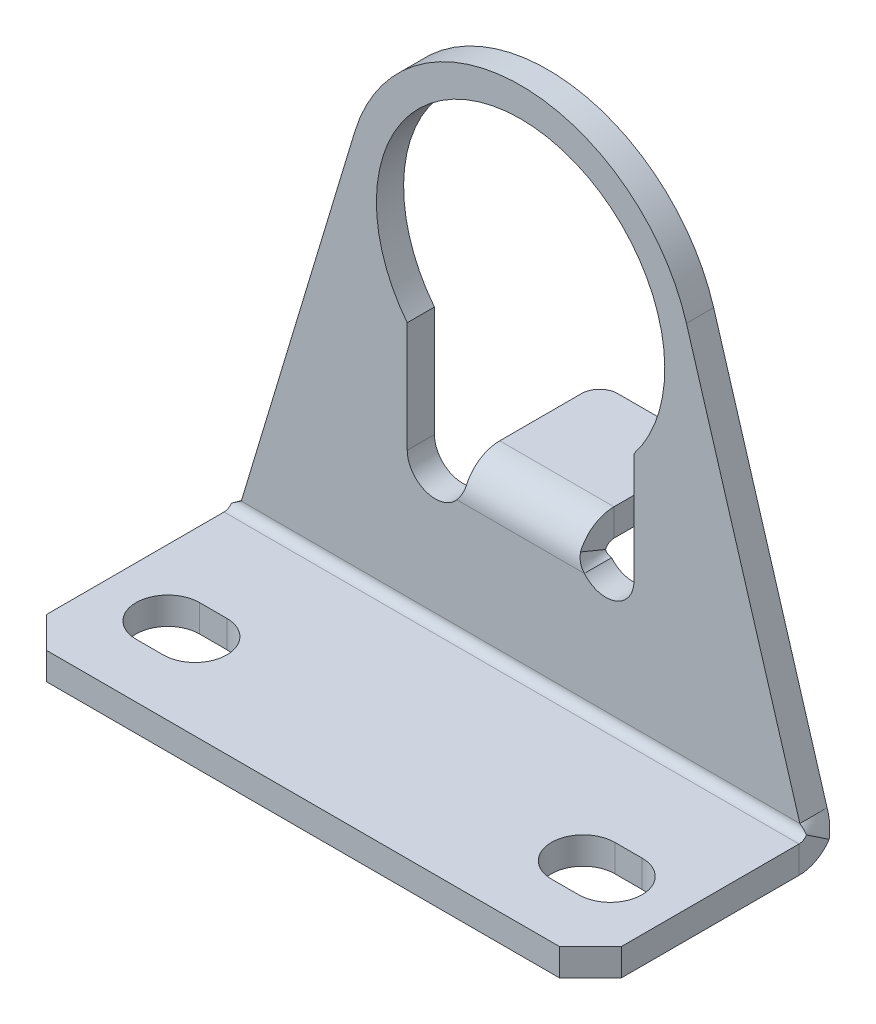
ISO-10303-21;
HEADER;
FILE_DESCRIPTION(('STEP AP214'),'2;1');
FILE_NAME('part.step','',(''),(''),'','','');
FILE_SCHEMA(('AUTOMOTIVE_DESIGN { 1 0 10303 214 1 1 1 1 }'));
ENDSEC;
DATA;
#1=APPLICATION_CONTEXT('core data for automotive mechanical design processes');
#2=APPLICATION_PROTOCOL_DEFINITION('international standard','automotive_design',2000,#1);
#3=PRODUCT_CONTEXT('',#1,'mechanical');
#4=PRODUCT('Part','Part','',(#3));
#5=PRODUCT_RELATED_PRODUCT_CATEGORY('part','',(#4));
#6=PRODUCT_DEFINITION_FORMATION('','',#4);
#7=PRODUCT_DEFINITION_CONTEXT('part definition',#1,'design');
#8=PRODUCT_DEFINITION('design','',#6,#7);
#9=PRODUCT_DEFINITION_SHAPE('','',#8);
#10=(LENGTH_UNIT() NAMED_UNIT(*) SI_UNIT(.MILLI.,.METRE.));
#11=(NAMED_UNIT(*) PLANE_ANGLE_UNIT() SI_UNIT($,.RADIAN.));
#12=(NAMED_UNIT(*) SI_UNIT($,.STERADIAN.) SOLID_ANGLE_UNIT());
#13=UNCERTAINTY_MEASURE_WITH_UNIT(LENGTH_MEASURE(1.E-05),#10,'distance_accuracy_value','');
#14=(GEOMETRIC_REPRESENTATION_CONTEXT(3) GLOBAL_UNCERTAINTY_ASSIGNED_CONTEXT((#13)) GLOBAL_UNIT_ASSIGNED_CONTEXT((#10,
#11,#12)) REPRESENTATION_CONTEXT('',''));
#15=CARTESIAN_POINT('',(0.,0.,0.));
#16=DIRECTION('',(0.,0.,1.));
#17=DIRECTION('',(1.,0.,0.));
#18=AXIS2_PLACEMENT_3D('',#15,#16,#17);
#19=CARTESIAN_POINT('',(14.1605,11.43,-15.24));
#20=DIRECTION('',(0.,0.,-1.));
#21=DIRECTION('',(0.,1.,0.));
#22=AXIS2_PLACEMENT_3D('',#19,#20,#21);
#23=CYLINDRICAL_SURFACE('',#22,1.9685);
#24=CARTESIAN_POINT('',(14.1605,11.43,-15.24));
#25=DIRECTION('',(0.,0.,1.));
#26=DIRECTION('',(0.,-1.,0.));
#27=AXIS2_PLACEMENT_3D('',#24,#25,#26);
#28=CIRCLE('',#27,1.9685);
#29=CARTESIAN_POINT('',(12.192,11.43,-15.24));
#30=VERTEX_POINT('',#29);
#31=CARTESIAN_POINT('',(15.6645253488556,10.16,-15.239999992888));
#32=VERTEX_POINT('',#31);
#33=EDGE_CURVE('E966',#30,#32,#28,.T.);
#34=ORIENTED_EDGE('',*,*,#33,.T.);
#35=CARTESIAN_POINT('',(15.6645253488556,10.16,-17.144999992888));
#36=CARTESIAN_POINT('',(15.6645253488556,10.16,-15.239999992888));
#37=B_SPLINE_CURVE_WITH_KNOTS('',1,(#35,#36),.UNSPECIFIED.,.F.,.F.,(2,2),(0.,1.),.UNSPECIFIED.);
#38=CARTESIAN_POINT('',(15.6645253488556,10.16,-17.145));
#39=VERTEX_POINT('',#38);
#40=EDGE_CURVE('E1051',#32,#39,#37,.F.);
#41=ORIENTED_EDGE('',*,*,#40,.T.);
#42=CARTESIAN_POINT('',(14.1605,11.43,-17.145));
#43=DIRECTION('',(0.,0.,1.));
#44=DIRECTION('',(0.,-1.,0.));
#45=AXIS2_PLACEMENT_3D('',#42,#43,#44);
#46=CIRCLE('',#45,1.9685);
#47=CARTESIAN_POINT('',(12.192,11.43,-17.145));
#48=VERTEX_POINT('',#47);
#49=EDGE_CURVE('E957',#48,#39,#46,.T.);
#50=ORIENTED_EDGE('',*,*,#49,.F.);
#51=DIRECTION('',(0.,0.,-1.));
#52=VECTOR('',#51,1.);
#53=CARTESIAN_POINT('',(12.192,11.43,-15.24));
#54=LINE('',#53,#52);
#55=EDGE_CURVE('E967',#30,#48,#54,.T.);
#56=ORIENTED_EDGE('',*,*,#55,.F.);
#57=EDGE_LOOP('',(#34,#41,#50,#56));
#58=FACE_BOUND('',#57,.T.);
#59=ADVANCED_FACE('F343',(#58),#23,.F.);
#60=CARTESIAN_POINT('',(26.0985,11.43,-15.24));
#61=DIRECTION('',(0.,0.,-1.));
#62=DIRECTION('',(0.,1.,0.));
#63=AXIS2_PLACEMENT_3D('',#60,#61,#62);
#64=CYLINDRICAL_SURFACE('',#63,1.9685);
#65=CARTESIAN_POINT('',(26.0985,11.43,-17.145));
#66=DIRECTION('',(0.,0.,1.));
#67=DIRECTION('',(0.,-1.,0.));
#68=AXIS2_PLACEMENT_3D('',#65,#66,#67);
#69=CIRCLE('',#68,1.9685);
#70=CARTESIAN_POINT('',(24.5944746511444,10.16,-17.144999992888));
#71=VERTEX_POINT('',#70);
#72=CARTESIAN_POINT('',(28.067,11.43,-17.145));
#73=VERTEX_POINT('',#72);
#74=EDGE_CURVE('E921',#71,#73,#69,.T.);
#75=ORIENTED_EDGE('',*,*,#74,.F.);
#76=CARTESIAN_POINT('',(24.5944746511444,10.16,-15.239999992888));
#77=CARTESIAN_POINT('',(24.5944746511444,10.16,-17.144999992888));
#78=B_SPLINE_CURVE_WITH_KNOTS('',1,(#76,#77),.UNSPECIFIED.,.F.,.F.,(2,2),(0.,1.),.UNSPECIFIED.);
#79=CARTESIAN_POINT('',(24.5944746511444,10.16,-15.239999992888));
#80=VERTEX_POINT('',#79);
#81=EDGE_CURVE('E770',#71,#80,#78,.F.);
#82=ORIENTED_EDGE('',*,*,#81,.T.);
#83=CARTESIAN_POINT('',(26.0985,11.43,-15.24));
#84=DIRECTION('',(0.,0.,1.));
#85=DIRECTION('',(0.,-1.,0.));
#86=AXIS2_PLACEMENT_3D('',#83,#84,#85);
#87=CIRCLE('',#86,1.9685);
#88=CARTESIAN_POINT('',(28.067,11.43,-15.24));
#89=VERTEX_POINT('',#88);
#90=EDGE_CURVE('E961',#80,#89,#87,.T.);
#91=ORIENTED_EDGE('',*,*,#90,.T.);
#92=DIRECTION('',(0.,0.,-1.));
#93=VECTOR('',#92,1.);
#94=CARTESIAN_POINT('',(28.067,11.43,-15.24));
#95=LINE('',#94,#93);
#96=EDGE_CURVE('E973',#89,#73,#95,.T.);
#97=ORIENTED_EDGE('',*,*,#96,.T.);
#98=EDGE_LOOP('',(#75,#82,#91,#97));
#99=FACE_BOUND('',#98,.T.);
#100=ADVANCED_FACE('F1026',(#99),#64,.F.);
#101=CARTESIAN_POINT('',(20.1295,25.4,-15.2399999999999));
#102=DIRECTION('',(0.,0.,1.));
#103=DIRECTION('',(0.,-1.,0.));
#104=AXIS2_PLACEMENT_3D('',#101,#102,#103);
#105=PLANE('',#104);
#106=DIRECTION('',(-1.,0.,0.));
#107=VECTOR('',#106,1.);
#108=CARTESIAN_POINT('',(20.1295,2.54,-15.24));
#109=LINE('',#108,#107);
#110=CARTESIAN_POINT('',(39.6849736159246,2.54,-15.24));
#111=VERTEX_POINT('',#110);
#112=CARTESIAN_POINT('',(0.574026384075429,2.54,-15.2400000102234));
#113=VERTEX_POINT('',#112);
#114=EDGE_CURVE('E990',#111,#113,#109,.T.);
#115=ORIENTED_EDGE('',*,*,#114,.F.);
#116=DIRECTION('',(-0.288512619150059,0.95747609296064,0.));
#117=VECTOR('',#116,1.);
#118=CARTESIAN_POINT('',(40.259,0.634999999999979,-15.24));
#119=LINE('',#118,#117);
#120=CARTESIAN_POINT('',(31.7422487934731,28.8992253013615,-15.2399999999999));
#121=VERTEX_POINT('',#120);
#122=EDGE_CURVE('E983',#111,#121,#119,.T.);
#123=ORIENTED_EDGE('',*,*,#122,.T.);
#124=CARTESIAN_POINT('',(20.1295,25.4,-15.2399999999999));
#125=DIRECTION('',(0.,0.,1.));
#126=DIRECTION('',(0.,-1.,0.));
#127=AXIS2_PLACEMENT_3D('',#124,#125,#126);
#128=CIRCLE('',#127,12.1285);
#129=CARTESIAN_POINT('',(8.51675120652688,28.8992253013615,-15.2399999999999));
#130=VERTEX_POINT('',#129);
#131=EDGE_CURVE('E980',#121,#130,#128,.T.);
#132=ORIENTED_EDGE('',*,*,#131,.T.);
#133=DIRECTION('',(-0.288512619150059,-0.95747609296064,0.));
#134=VECTOR('',#133,1.);
#135=CARTESIAN_POINT('',(0.,0.634999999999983,-15.24));
#136=LINE('',#135,#134);
#137=EDGE_CURVE('E982',#130,#113,#136,.T.);
#138=ORIENTED_EDGE('',*,*,#137,.T.);
#139=EDGE_LOOP('',(#115,#123,#132,#138));
#140=FACE_BOUND('',#139,.T.);
#141=ORIENTED_EDGE('',*,*,#90,.F.);
#142=DIRECTION('',(-1.,0.,0.));
#143=VECTOR('',#142,1.);
#144=CARTESIAN_POINT('',(20.1295,10.16,-15.24));
#145=LINE('',#144,#143);
#146=EDGE_CURVE('E1155',#80,#32,#145,.T.);
#147=ORIENTED_EDGE('',*,*,#146,.T.);
#148=ORIENTED_EDGE('',*,*,#33,.F.);
#149=DIRECTION('',(0.,-1.,0.));
#150=VECTOR('',#149,1.);
#151=CARTESIAN_POINT('',(12.192,19.1601758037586,-15.2399999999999));
#152=LINE('',#151,#150);
#153=CARTESIAN_POINT('',(12.192,19.1601758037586,-15.2399999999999));
#154=VERTEX_POINT('',#153);
#155=EDGE_CURVE('E963',#154,#30,#152,.T.);
#156=ORIENTED_EDGE('',*,*,#155,.F.);
#157=CARTESIAN_POINT('',(20.1295,25.4,-15.2399999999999));
#158=DIRECTION('',(0.,0.,1.));
#159=DIRECTION('',(0.,-1.,0.));
#160=AXIS2_PLACEMENT_3D('',#157,#158,#159);
#161=CIRCLE('',#160,10.0965);
#162=CARTESIAN_POINT('',(28.067,19.1601758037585,-15.2399999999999));
#163=VERTEX_POINT('',#162);
#164=EDGE_CURVE('E960',#163,#154,#161,.T.);
#165=ORIENTED_EDGE('',*,*,#164,.F.);
#166=DIRECTION('',(0.,1.,0.));
#167=VECTOR('',#166,1.);
#168=CARTESIAN_POINT('',(28.067,19.1601758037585,-15.2399999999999));
#169=LINE('',#168,#167);
#170=EDGE_CURVE('E958',#89,#163,#169,.T.);
#171=ORIENTED_EDGE('',*,*,#170,.F.);
#172=EDGE_LOOP('',(#141,#147,#148,#156,#165,#171));
#173=FACE_BOUND('',#172,.T.);
#174=ADVANCED_FACE('F1030',(#140,#173),#105,.T.);
#175=CARTESIAN_POINT('',(0.,0.634999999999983,-15.24));
#176=DIRECTION('',(0.957476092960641,-0.288512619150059,0.));
#177=DIRECTION('',(0.288512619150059,0.957476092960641,0.));
#178=AXIS2_PLACEMENT_3D('',#175,#176,#177);
#179=PLANE('',#178);
#180=DIRECTION('',(-0.288512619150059,-0.95747609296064,0.));
#181=VECTOR('',#180,1.);
#182=CARTESIAN_POINT('',(0.,0.63499999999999,-17.145));
#183=LINE('',#182,#181);
#184=CARTESIAN_POINT('',(8.51675120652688,28.8992253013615,-17.1449999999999));
#185=VERTEX_POINT('',#184);
#186=CARTESIAN_POINT('',(0.574026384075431,2.54000000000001,-17.145));
#187=VERTEX_POINT('',#186);
#188=EDGE_CURVE('E979',#185,#187,#183,.T.);
#189=ORIENTED_EDGE('',*,*,#188,.T.);
#190=CARTESIAN_POINT('',(0.574026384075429,2.54,-15.2400000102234));
#191=CARTESIAN_POINT('',(0.574026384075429,2.54000000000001,-17.1450000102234));
#192=B_SPLINE_CURVE_WITH_KNOTS('',1,(#190,#191),.UNSPECIFIED.,.F.,.F.,(2,2),(0.,1.),.UNSPECIFIED.);
#193=EDGE_CURVE('E996',#187,#113,#192,.F.);
#194=ORIENTED_EDGE('',*,*,#193,.T.);
#195=ORIENTED_EDGE('',*,*,#137,.F.);
#196=DIRECTION('',(0.,0.,-1.));
#197=VECTOR('',#196,1.);
#198=CARTESIAN_POINT('',(8.51675120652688,28.8992253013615,-15.2399999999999));
#199=LINE('',#198,#197);
#200=EDGE_CURVE('E984',#130,#185,#199,.T.);
#201=ORIENTED_EDGE('',*,*,#200,.T.);
#202=EDGE_LOOP('',(#189,#194,#195,#201));
#203=FACE_BOUND('',#202,.T.);
#204=ADVANCED_FACE('F1023',(#203),#179,.F.);
#205=CARTESIAN_POINT('',(40.259,0.634999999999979,-15.24));
#206=DIRECTION('',(-0.957476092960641,-0.288512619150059,0.));
#207=DIRECTION('',(0.288512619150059,-0.957476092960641,0.));
#208=AXIS2_PLACEMENT_3D('',#205,#206,#207);
#209=PLANE('',#208);
#210=ORIENTED_EDGE('',*,*,#122,.F.);
#211=CARTESIAN_POINT('',(39.6849736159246,2.54000000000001,-17.1450000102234));
#212=CARTESIAN_POINT('',(39.6849736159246,2.54,-15.2400000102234));
#213=B_SPLINE_CURVE_WITH_KNOTS('',1,(#211,#212),.UNSPECIFIED.,.F.,.F.,(2,2),(0.,1.),.UNSPECIFIED.);
#214=CARTESIAN_POINT('',(39.6849736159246,2.54000000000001,-17.145));
#215=VERTEX_POINT('',#214);
#216=EDGE_CURVE('E1006',#111,#215,#213,.F.);
#217=ORIENTED_EDGE('',*,*,#216,.T.);
#218=DIRECTION('',(-0.288512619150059,0.95747609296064,0.));
#219=VECTOR('',#218,1.);
#220=CARTESIAN_POINT('',(40.259,0.634999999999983,-17.145));
#221=LINE('',#220,#219);
#222=CARTESIAN_POINT('',(31.7422487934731,28.8992253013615,-17.1449999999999));
#223=VERTEX_POINT('',#222);
#224=EDGE_CURVE('E976',#215,#223,#221,.T.);
#225=ORIENTED_EDGE('',*,*,#224,.T.);
#226=DIRECTION('',(0.,0.,-1.));
#227=VECTOR('',#226,1.);
#228=CARTESIAN_POINT('',(31.7422487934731,28.8992253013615,-15.2399999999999));
#229=LINE('',#228,#227);
#230=EDGE_CURVE('E987',#121,#223,#229,.T.);
#231=ORIENTED_EDGE('',*,*,#230,.F.);
#232=EDGE_LOOP('',(#210,#217,#225,#231));
#233=FACE_BOUND('',#232,.T.);
#234=ADVANCED_FACE('F1013',(#233),#209,.F.);
#235=CARTESIAN_POINT('',(20.1295,25.4,-17.1449999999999));
#236=DIRECTION('',(0.,0.,1.));
#237=DIRECTION('',(0.,-1.,0.));
#238=AXIS2_PLACEMENT_3D('',#235,#236,#237);
#239=PLANE('',#238);
#240=DIRECTION('',(-1.,0.,0.));
#241=VECTOR('',#240,1.);
#242=CARTESIAN_POINT('',(20.1295,10.16,-17.145));
#243=LINE('',#242,#241);
#244=EDGE_CURVE('E1137',#71,#39,#243,.T.);
#245=ORIENTED_EDGE('',*,*,#244,.F.);
#246=ORIENTED_EDGE('',*,*,#74,.T.);
#247=DIRECTION('',(0.,1.,0.));
#248=VECTOR('',#247,1.);
#249=CARTESIAN_POINT('',(28.067,19.1601758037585,-17.1449999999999));
#250=LINE('',#249,#248);
#251=CARTESIAN_POINT('',(28.067,19.1601758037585,-17.1449999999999));
#252=VERTEX_POINT('',#251);
#253=EDGE_CURVE('E948',#73,#252,#250,.T.);
#254=ORIENTED_EDGE('',*,*,#253,.T.);
#255=CARTESIAN_POINT('',(20.1295,25.4,-17.1449999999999));
#256=DIRECTION('',(0.,0.,1.));
#257=DIRECTION('',(0.,-1.,0.));
#258=AXIS2_PLACEMENT_3D('',#255,#256,#257);
#259=CIRCLE('',#258,10.0965);
#260=CARTESIAN_POINT('',(12.192,19.1601758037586,-17.1449999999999));
#261=VERTEX_POINT('',#260);
#262=EDGE_CURVE('E951',#252,#261,#259,.T.);
#263=ORIENTED_EDGE('',*,*,#262,.T.);
#264=DIRECTION('',(0.,-1.,0.));
#265=VECTOR('',#264,1.);
#266=CARTESIAN_POINT('',(12.192,19.1601758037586,-17.1449999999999));
#267=LINE('',#266,#265);
#268=EDGE_CURVE('E954',#261,#48,#267,.T.);
#269=ORIENTED_EDGE('',*,*,#268,.T.);
#270=ORIENTED_EDGE('',*,*,#49,.T.);
#271=EDGE_LOOP('',(#245,#246,#254,#263,#269,#270));
#272=FACE_BOUND('',#271,.T.);
#273=ORIENTED_EDGE('',*,*,#224,.F.);
#274=DIRECTION('',(-1.,0.,0.));
#275=VECTOR('',#274,1.);
#276=CARTESIAN_POINT('',(20.1295,2.54000000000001,-17.145));
#277=LINE('',#276,#275);
#278=EDGE_CURVE('E1011',#215,#187,#277,.T.);
#279=ORIENTED_EDGE('',*,*,#278,.T.);
#280=ORIENTED_EDGE('',*,*,#188,.F.);
#281=CARTESIAN_POINT('',(20.1295,25.4,-17.1449999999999));
#282=DIRECTION('',(0.,0.,1.));
#283=DIRECTION('',(0.,-1.,0.));
#284=AXIS2_PLACEMENT_3D('',#281,#282,#283);
#285=CIRCLE('',#284,12.1285);
#286=EDGE_CURVE('E977',#223,#185,#285,.T.);
#287=ORIENTED_EDGE('',*,*,#286,.F.);
#288=EDGE_LOOP('',(#273,#279,#280,#287));
#289=FACE_BOUND('',#288,.T.);
#290=ADVANCED_FACE('F345',(#272,#289),#239,.F.);
#291=CARTESIAN_POINT('',(20.1295,25.4,-15.2399999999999));
#292=DIRECTION('',(0.,0.,-1.));
#293=DIRECTION('',(0.,1.,0.));
#294=AXIS2_PLACEMENT_3D('',#291,#292,#293);
#295=CYLINDRICAL_SURFACE('',#294,12.1285);
#296=ORIENTED_EDGE('',*,*,#286,.T.);
#297=ORIENTED_EDGE('',*,*,#200,.F.);
#298=ORIENTED_EDGE('',*,*,#131,.F.);
#299=ORIENTED_EDGE('',*,*,#230,.T.);
#300=EDGE_LOOP('',(#296,#297,#298,#299));
#301=FACE_BOUND('',#300,.T.);
#302=ADVANCED_FACE('F1290',(#301),#295,.T.);
#303=CARTESIAN_POINT('',(28.067,19.1601758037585,-15.2399999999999));
#304=DIRECTION('',(-1.,0.,0.));
#305=DIRECTION('',(0.,-1.,0.));
#306=AXIS2_PLACEMENT_3D('',#303,#304,#305);
#307=PLANE('',#306);
#308=ORIENTED_EDGE('',*,*,#253,.F.);
#309=ORIENTED_EDGE('',*,*,#96,.F.);
#310=ORIENTED_EDGE('',*,*,#170,.T.);
#311=DIRECTION('',(0.,0.,-1.));
#312=VECTOR('',#311,1.);
#313=CARTESIAN_POINT('',(28.067,19.1601758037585,-15.2399999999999));
#314=LINE('',#313,#312);
#315=EDGE_CURVE('E971',#163,#252,#314,.T.);
#316=ORIENTED_EDGE('',*,*,#315,.T.);
#317=EDGE_LOOP('',(#308,#309,#310,#316));
#318=FACE_BOUND('',#317,.T.);
#319=ADVANCED_FACE('F1174',(#318),#307,.T.);
#320=CARTESIAN_POINT('',(20.1295,25.4,-15.2399999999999));
#321=DIRECTION('',(0.,0.,-1.));
#322=DIRECTION('',(0.,1.,0.));
#323=AXIS2_PLACEMENT_3D('',#320,#321,#322);
#324=CYLINDRICAL_SURFACE('',#323,10.0965);
#325=ORIENTED_EDGE('',*,*,#262,.F.);
#326=ORIENTED_EDGE('',*,*,#315,.F.);
#327=ORIENTED_EDGE('',*,*,#164,.T.);
#328=DIRECTION('',(0.,0.,-1.));
#329=VECTOR('',#328,1.);
#330=CARTESIAN_POINT('',(12.192,19.1601758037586,-15.2399999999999));
#331=LINE('',#330,#329);
#332=EDGE_CURVE('E969',#154,#261,#331,.T.);
#333=ORIENTED_EDGE('',*,*,#332,.T.);
#334=EDGE_LOOP('',(#325,#326,#327,#333));
#335=FACE_BOUND('',#334,.T.);
#336=ADVANCED_FACE('F1181',(#335),#324,.F.);
#337=CARTESIAN_POINT('',(12.192,19.1601758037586,-15.2399999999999));
#338=DIRECTION('',(1.,0.,0.));
#339=DIRECTION('',(0.,1.,0.));
#340=AXIS2_PLACEMENT_3D('',#337,#338,#339);
#341=PLANE('',#340);
#342=ORIENTED_EDGE('',*,*,#268,.F.);
#343=ORIENTED_EDGE('',*,*,#332,.F.);
#344=ORIENTED_EDGE('',*,*,#155,.T.);
#345=ORIENTED_EDGE('',*,*,#55,.T.);
#346=EDGE_LOOP('',(#342,#343,#344,#345));
#347=FACE_BOUND('',#346,.T.);
#348=ADVANCED_FACE('F1183',(#347),#341,.T.);
#349=CARTESIAN_POINT('',(0.,1.905,0.));
#350=DIRECTION('',(0.,0.,-1.));
#351=DIRECTION('',(-1.,0.,0.));
#352=AXIS2_PLACEMENT_3D('',#349,#350,#351);
#353=PLANE('',#352);
#354=DIRECTION('',(1.,0.,0.));
#355=VECTOR('',#354,1.);
#356=CARTESIAN_POINT('',(0.,0.,0.));
#357=LINE('',#356,#355);
#358=CARTESIAN_POINT('',(2.159,0.,0.));
#359=VERTEX_POINT('',#358);
#360=CARTESIAN_POINT('',(38.1,0.,0.));
#361=VERTEX_POINT('',#360);
#362=EDGE_CURVE('E936',#359,#361,#357,.T.);
#363=ORIENTED_EDGE('',*,*,#362,.T.);
#364=DIRECTION('',(0.,1.,0.));
#365=VECTOR('',#364,1.);
#366=CARTESIAN_POINT('',(38.1,1.905,0.));
#367=LINE('',#366,#365);
#368=CARTESIAN_POINT('',(38.1,1.905,0.));
#369=VERTEX_POINT('',#368);
#370=EDGE_CURVE('E1058',#361,#369,#367,.T.);
#371=ORIENTED_EDGE('',*,*,#370,.T.);
#372=DIRECTION('',(1.,0.,0.));
#373=VECTOR('',#372,1.);
#374=CARTESIAN_POINT('',(0.,1.905,0.));
#375=LINE('',#374,#373);
#376=CARTESIAN_POINT('',(2.15899999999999,1.905,0.));
#377=VERTEX_POINT('',#376);
#378=EDGE_CURVE('E925',#377,#369,#375,.T.);
#379=ORIENTED_EDGE('',*,*,#378,.F.);
#380=DIRECTION('',(0.,-1.,0.));
#381=VECTOR('',#380,1.);
#382=CARTESIAN_POINT('',(2.159,1.905,0.));
#383=LINE('',#382,#381);
#384=EDGE_CURVE('E1055',#377,#359,#383,.T.);
#385=ORIENTED_EDGE('',*,*,#384,.T.);
#386=EDGE_LOOP('',(#363,#371,#379,#385));
#387=FACE_BOUND('',#386,.T.);
#388=ADVANCED_FACE('F1247',(#387),#353,.F.);
#389=CARTESIAN_POINT('',(20.1295,1.905,-42.545));
#390=DIRECTION('',(0.,1.,0.));
#391=DIRECTION('',(0.,0.,1.));
#392=AXIS2_PLACEMENT_3D('',#389,#390,#391);
#393=PLANE('',#392);
#394=CARTESIAN_POINT('',(33.7185,1.905,-6.0325));
#395=DIRECTION('',(0.,1.,0.));
#396=DIRECTION('',(0.,0.,1.));
#397=AXIS2_PLACEMENT_3D('',#394,#395,#396);
#398=CIRCLE('',#397,2.2225);
#399=CARTESIAN_POINT('',(33.7185,1.905,-8.255));
#400=VERTEX_POINT('',#399);
#401=CARTESIAN_POINT('',(33.7185,1.905,-3.81));
#402=VERTEX_POINT('',#401);
#403=EDGE_CURVE('E587',#400,#402,#398,.T.);
#404=ORIENTED_EDGE('',*,*,#403,.F.);
#405=DIRECTION('',(-1.,0.,0.));
#406=VECTOR('',#405,1.);
#407=CARTESIAN_POINT('',(33.7185,1.905,-8.255));
#408=LINE('',#407,#406);
#409=CARTESIAN_POINT('',(35.6235,1.905,-8.255));
#410=VERTEX_POINT('',#409);
#411=EDGE_CURVE('E592',#410,#400,#408,.T.);
#412=ORIENTED_EDGE('',*,*,#411,.F.);
#413=CARTESIAN_POINT('',(35.6235,1.905,-6.0325));
#414=DIRECTION('',(0.,1.,0.));
#415=DIRECTION('',(0.,0.,1.));
#416=AXIS2_PLACEMENT_3D('',#413,#414,#415);
#417=CIRCLE('',#416,2.2225);
#418=CARTESIAN_POINT('',(35.6235,1.905,-3.81));
#419=VERTEX_POINT('',#418);
#420=EDGE_CURVE('E571',#419,#410,#417,.T.);
#421=ORIENTED_EDGE('',*,*,#420,.F.);
#422=DIRECTION('',(1.,0.,0.));
#423=VECTOR('',#422,1.);
#424=CARTESIAN_POINT('',(33.7185,1.905,-3.81));
#425=LINE('',#424,#423);
#426=EDGE_CURVE('E583',#402,#419,#425,.T.);
#427=ORIENTED_EDGE('',*,*,#426,.F.);
#428=EDGE_LOOP('',(#404,#412,#421,#427));
#429=FACE_BOUND('',#428,.T.);
#430=CARTESIAN_POINT('',(4.6355,1.905,-6.0325));
#431=DIRECTION('',(0.,1.,0.));
#432=DIRECTION('',(0.,0.,1.));
#433=AXIS2_PLACEMENT_3D('',#430,#431,#432);
#434=CIRCLE('',#433,2.2225);
#435=CARTESIAN_POINT('',(4.6355,1.905,-8.255));
#436=VERTEX_POINT('',#435);
#437=CARTESIAN_POINT('',(4.6355,1.905,-3.81));
#438=VERTEX_POINT('',#437);
#439=EDGE_CURVE('E601',#436,#438,#434,.T.);
#440=ORIENTED_EDGE('',*,*,#439,.F.);
#441=DIRECTION('',(-1.,0.,0.));
#442=VECTOR('',#441,1.);
#443=CARTESIAN_POINT('',(4.6355,1.905,-8.255));
#444=LINE('',#443,#442);
#445=CARTESIAN_POINT('',(6.5405,1.905,-8.255));
#446=VERTEX_POINT('',#445);
#447=EDGE_CURVE('E609',#446,#436,#444,.T.);
#448=ORIENTED_EDGE('',*,*,#447,.F.);
#449=CARTESIAN_POINT('',(6.5405,1.905,-6.0325));
#450=DIRECTION('',(0.,1.,0.));
#451=DIRECTION('',(0.,0.,1.));
#452=AXIS2_PLACEMENT_3D('',#449,#450,#451);
#453=CIRCLE('',#452,2.2225);
#454=CARTESIAN_POINT('',(6.5405,1.905,-3.81));
#455=VERTEX_POINT('',#454);
#456=EDGE_CURVE('E606',#455,#446,#453,.T.);
#457=ORIENTED_EDGE('',*,*,#456,.F.);
#458=DIRECTION('',(1.,0.,0.));
#459=VECTOR('',#458,1.);
#460=CARTESIAN_POINT('',(4.6355,1.905,-3.81));
#461=LINE('',#460,#459);
#462=EDGE_CURVE('E603',#438,#455,#461,.T.);
#463=ORIENTED_EDGE('',*,*,#462,.F.);
#464=EDGE_LOOP('',(#440,#448,#457,#463));
#465=FACE_BOUND('',#464,.T.);
#466=ORIENTED_EDGE('',*,*,#378,.T.);
#467=DIRECTION('',(-0.70710678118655,0.,0.707106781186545));
#468=VECTOR('',#467,1.);
#469=CARTESIAN_POINT('',(50.3872499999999,1.905,-12.2872499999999));
#470=LINE('',#469,#468);
#471=CARTESIAN_POINT('',(40.259,1.905,-2.159));
#472=VERTEX_POINT('',#471);
#473=EDGE_CURVE('E1062',#369,#472,#470,.F.);
#474=ORIENTED_EDGE('',*,*,#473,.T.);
#475=DIRECTION('',(0.,0.,-1.));
#476=VECTOR('',#475,1.);
#477=CARTESIAN_POINT('',(40.259,1.905,0.));
#478=LINE('',#477,#476);
#479=CARTESIAN_POINT('',(40.259,1.905,-14.605));
#480=VERTEX_POINT('',#479);
#481=EDGE_CURVE('E934',#472,#480,#478,.T.);
#482=ORIENTED_EDGE('',*,*,#481,.T.);
#483=DIRECTION('',(-1.,0.,0.));
#484=VECTOR('',#483,1.);
#485=CARTESIAN_POINT('',(20.1295,1.905,-14.605));
#486=LINE('',#485,#484);
#487=CARTESIAN_POINT('',(0.,1.90499999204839,-14.605));
#488=VERTEX_POINT('',#487);
#489=EDGE_CURVE('E931',#480,#488,#486,.T.);
#490=ORIENTED_EDGE('',*,*,#489,.T.);
#491=DIRECTION('',(0.,0.,1.));
#492=VECTOR('',#491,1.);
#493=CARTESIAN_POINT('',(0.,1.905,0.));
#494=LINE('',#493,#492);
#495=CARTESIAN_POINT('',(0.,1.905,-2.15899999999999));
#496=VERTEX_POINT('',#495);
#497=EDGE_CURVE('E928',#488,#496,#494,.T.);
#498=ORIENTED_EDGE('',*,*,#497,.T.);
#499=DIRECTION('',(-0.707106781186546,0.,-0.707106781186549));
#500=VECTOR('',#499,1.);
#501=CARTESIAN_POINT('',(-10.12825,1.905,-12.2872500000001));
#502=LINE('',#501,#500);
#503=EDGE_CURVE('E1060',#496,#377,#502,.F.);
#504=ORIENTED_EDGE('',*,*,#503,.T.);
#505=EDGE_LOOP('',(#466,#474,#482,#490,#498,#504));
#506=FACE_BOUND('',#505,.T.);
#507=ADVANCED_FACE('F589',(#429,#465,#506),#393,.T.);
#508=CARTESIAN_POINT('',(0.,1.905,0.));
#509=DIRECTION('',(1.,0.,0.));
#510=DIRECTION('',(0.,0.,-1.));
#511=AXIS2_PLACEMENT_3D('',#508,#509,#510);
#512=PLANE('',#511);
#513=DIRECTION('',(0.,0.,1.));
#514=VECTOR('',#513,1.);
#515=CARTESIAN_POINT('',(0.,0.,0.));
#516=LINE('',#515,#514);
#517=CARTESIAN_POINT('',(0.,0.,-14.605));
#518=VERTEX_POINT('',#517);
#519=CARTESIAN_POINT('',(0.,0.,-2.15900000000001));
#520=VERTEX_POINT('',#519);
#521=EDGE_CURVE('E922',#518,#520,#516,.T.);
#522=ORIENTED_EDGE('',*,*,#521,.T.);
#523=DIRECTION('',(0.,1.,0.));
#524=VECTOR('',#523,1.);
#525=CARTESIAN_POINT('',(0.,1.905,-2.15900000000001));
#526=LINE('',#525,#524);
#527=EDGE_CURVE('E1064',#520,#496,#526,.T.);
#528=ORIENTED_EDGE('',*,*,#527,.T.);
#529=ORIENTED_EDGE('',*,*,#497,.F.);
#530=DIRECTION('',(0.,1.,0.));
#531=VECTOR('',#530,1.);
#532=CARTESIAN_POINT('',(0.,1.905,-14.605));
#533=LINE('',#532,#531);
#534=EDGE_CURVE('E939',#518,#488,#533,.T.);
#535=ORIENTED_EDGE('',*,*,#534,.F.);
#536=EDGE_LOOP('',(#522,#528,#529,#535));
#537=FACE_BOUND('',#536,.T.);
#538=ADVANCED_FACE('F1228',(#537),#512,.F.);
#539=CARTESIAN_POINT('',(20.1295,0.,-42.545));
#540=DIRECTION('',(0.,1.,0.));
#541=DIRECTION('',(0.,0.,1.));
#542=AXIS2_PLACEMENT_3D('',#539,#540,#541);
#543=PLANE('',#542);
#544=DIRECTION('',(1.,0.,0.));
#545=VECTOR('',#544,1.);
#546=CARTESIAN_POINT('',(20.1295,0.,-8.255));
#547=LINE('',#546,#545);
#548=CARTESIAN_POINT('',(35.6235,0.,-8.255));
#549=VERTEX_POINT('',#548);
#550=CARTESIAN_POINT('',(33.7185,0.,-8.255));
#551=VERTEX_POINT('',#550);
#552=EDGE_CURVE('E1081',#549,#551,#547,.F.);
#553=ORIENTED_EDGE('',*,*,#552,.T.);
#554=CARTESIAN_POINT('',(33.7185,0.,-6.0325));
#555=DIRECTION('',(0.,1.,0.));
#556=DIRECTION('',(0.,0.,1.));
#557=AXIS2_PLACEMENT_3D('',#554,#555,#556);
#558=CIRCLE('',#557,2.2225);
#559=CARTESIAN_POINT('',(33.7185,0.,-3.81));
#560=VERTEX_POINT('',#559);
#561=EDGE_CURVE('E1084',#551,#560,#558,.T.);
#562=ORIENTED_EDGE('',*,*,#561,.T.);
#563=DIRECTION('',(1.,0.,0.));
#564=VECTOR('',#563,1.);
#565=CARTESIAN_POINT('',(20.1295,0.,-3.81));
#566=LINE('',#565,#564);
#567=CARTESIAN_POINT('',(35.6235,0.,-3.81));
#568=VERTEX_POINT('',#567);
#569=EDGE_CURVE('E1078',#560,#568,#566,.T.);
#570=ORIENTED_EDGE('',*,*,#569,.T.);
#571=CARTESIAN_POINT('',(35.6235,0.,-6.0325));
#572=DIRECTION('',(0.,1.,0.));
#573=DIRECTION('',(0.,0.,1.));
#574=AXIS2_PLACEMENT_3D('',#571,#572,#573);
#575=CIRCLE('',#574,2.2225);
#576=EDGE_CURVE('E574',#568,#549,#575,.T.);
#577=ORIENTED_EDGE('',*,*,#576,.T.);
#578=EDGE_LOOP('',(#553,#562,#570,#577));
#579=FACE_BOUND('',#578,.T.);
#580=DIRECTION('',(1.,0.,0.));
#581=VECTOR('',#580,1.);
#582=CARTESIAN_POINT('',(20.1295,0.,-8.255));
#583=LINE('',#582,#581);
#584=CARTESIAN_POINT('',(6.5405,0.,-8.255));
#585=VERTEX_POINT('',#584);
#586=CARTESIAN_POINT('',(4.6355,0.,-8.255));
#587=VERTEX_POINT('',#586);
#588=EDGE_CURVE('E1072',#585,#587,#583,.F.);
#589=ORIENTED_EDGE('',*,*,#588,.T.);
#590=CARTESIAN_POINT('',(4.6355,0.,-6.0325));
#591=DIRECTION('',(0.,1.,0.));
#592=DIRECTION('',(0.,0.,1.));
#593=AXIS2_PLACEMENT_3D('',#590,#591,#592);
#594=CIRCLE('',#593,2.2225);
#595=CARTESIAN_POINT('',(4.6355,0.,-3.81));
#596=VERTEX_POINT('',#595);
#597=EDGE_CURVE('E1075',#587,#596,#594,.T.);
#598=ORIENTED_EDGE('',*,*,#597,.T.);
#599=DIRECTION('',(1.,0.,0.));
#600=VECTOR('',#599,1.);
#601=CARTESIAN_POINT('',(20.1295,0.,-3.81000000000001));
#602=LINE('',#601,#600);
#603=CARTESIAN_POINT('',(6.5405,0.,-3.81));
#604=VERTEX_POINT('',#603);
#605=EDGE_CURVE('E1066',#596,#604,#602,.T.);
#606=ORIENTED_EDGE('',*,*,#605,.T.);
#607=CARTESIAN_POINT('',(6.5405,0.,-6.0325));
#608=DIRECTION('',(0.,1.,0.));
#609=DIRECTION('',(0.,0.,1.));
#610=AXIS2_PLACEMENT_3D('',#607,#608,#609);
#611=CIRCLE('',#610,2.2225);
#612=EDGE_CURVE('E1069',#604,#585,#611,.T.);
#613=ORIENTED_EDGE('',*,*,#612,.T.);
#614=EDGE_LOOP('',(#589,#598,#606,#613));
#615=FACE_BOUND('',#614,.T.);
#616=DIRECTION('',(0.,0.,-1.));
#617=VECTOR('',#616,1.);
#618=CARTESIAN_POINT('',(40.259,0.,0.));
#619=LINE('',#618,#617);
#620=CARTESIAN_POINT('',(40.259,0.,-2.159));
#621=VERTEX_POINT('',#620);
#622=CARTESIAN_POINT('',(40.259,0.,-14.605));
#623=VERTEX_POINT('',#622);
#624=EDGE_CURVE('E914',#621,#623,#619,.T.);
#625=ORIENTED_EDGE('',*,*,#624,.F.);
#626=DIRECTION('',(0.70710678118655,0.,-0.707106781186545));
#627=VECTOR('',#626,1.);
#628=CARTESIAN_POINT('',(40.259,0.,-2.159));
#629=LINE('',#628,#627);
#630=EDGE_CURVE('E1053',#621,#361,#629,.F.);
#631=ORIENTED_EDGE('',*,*,#630,.T.);
#632=ORIENTED_EDGE('',*,*,#362,.F.);
#633=DIRECTION('',(0.707106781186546,0.,0.707106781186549));
#634=VECTOR('',#633,1.);
#635=CARTESIAN_POINT('',(2.159,0.,0.));
#636=LINE('',#635,#634);
#637=EDGE_CURVE('E1050',#359,#520,#636,.F.);
#638=ORIENTED_EDGE('',*,*,#637,.T.);
#639=ORIENTED_EDGE('',*,*,#521,.F.);
#640=DIRECTION('',(-1.,0.,0.));
#641=VECTOR('',#640,1.);
#642=CARTESIAN_POINT('',(20.1295,0.,-14.605));
#643=LINE('',#642,#641);
#644=EDGE_CURVE('E942',#623,#518,#643,.T.);
#645=ORIENTED_EDGE('',*,*,#644,.F.);
#646=EDGE_LOOP('',(#625,#631,#632,#638,#639,#645));
#647=FACE_BOUND('',#646,.T.);
#648=ADVANCED_FACE('F1233',(#579,#615,#647),#543,.F.);
#649=CARTESIAN_POINT('',(40.259,1.905,0.));
#650=DIRECTION('',(-1.,0.,0.));
#651=DIRECTION('',(0.,0.,1.));
#652=AXIS2_PLACEMENT_3D('',#649,#650,#651);
#653=PLANE('',#652);
#654=ORIENTED_EDGE('',*,*,#481,.F.);
#655=DIRECTION('',(0.,-1.,0.));
#656=VECTOR('',#655,1.);
#657=CARTESIAN_POINT('',(40.259,1.905,-2.159));
#658=LINE('',#657,#656);
#659=EDGE_CURVE('E1047',#472,#621,#658,.T.);
#660=ORIENTED_EDGE('',*,*,#659,.T.);
#661=ORIENTED_EDGE('',*,*,#624,.T.);
#662=DIRECTION('',(0.,-1.,0.));
#663=VECTOR('',#662,1.);
#664=CARTESIAN_POINT('',(40.259,1.905,-14.605));
#665=LINE('',#664,#663);
#666=EDGE_CURVE('E945',#480,#623,#665,.T.);
#667=ORIENTED_EDGE('',*,*,#666,.F.);
#668=EDGE_LOOP('',(#654,#660,#661,#667));
#669=FACE_BOUND('',#668,.T.);
#670=ADVANCED_FACE('F870',(#669),#653,.F.);
#671=CARTESIAN_POINT('',(40.259,1.12885160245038,-16.7169328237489));
#672=CARTESIAN_POINT('',(40.0672388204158,1.54443681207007,-16.994617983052));
#673=CARTESIAN_POINT('',(39.8767347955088,2.04017991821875,-17.1450000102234));
#674=CARTESIAN_POINT('',(39.6849736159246,2.54000000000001,-17.1450000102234));
#675=CARTESIAN_POINT('',(40.259,2.18721289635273,-15.1329832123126));
#676=CARTESIAN_POINT('',(40.0674782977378,2.29097945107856,-15.2023178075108));
#677=CARTESIAN_POINT('',(39.8764953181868,2.41520102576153,-15.2400000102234));
#678=CARTESIAN_POINT('',(39.6849736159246,2.54,-15.2400000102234));
#679=B_SPLINE_SURFACE_WITH_KNOTS('',1,3,((#671,#672,#673,#674),(#675,#676,#677,#678)),
.UNSPECIFIED.,.F.,.F.,.F.,(2,2),(4,4),(0.,1.),(0.,1.),.UNSPECIFIED.);
#680=CARTESIAN_POINT('',(40.259,2.18721289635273,-15.1329832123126));
#681=CARTESIAN_POINT('',(40.259,1.12885160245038,-16.7169328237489));
#682=B_SPLINE_CURVE_WITH_KNOTS('',1,(#680,#681),.UNSPECIFIED.,.F.,.F.,(2,2),(0.,1.),.UNSPECIFIED.);
#683=CARTESIAN_POINT('',(40.259,1.12885160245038,-16.7169328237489));
#684=VERTEX_POINT('',#683);
#685=CARTESIAN_POINT('',(40.259,2.18721289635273,-15.1329832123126));
#686=VERTEX_POINT('',#685);
#687=EDGE_CURVE('E902',#684,#686,#682,.F.);
#688=CARTESIAN_POINT('',(40.259,1.12885160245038,-16.7169328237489));
#689=CARTESIAN_POINT('',(40.0672388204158,1.54443681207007,-16.994617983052));
#690=CARTESIAN_POINT('',(39.8767347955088,2.04017991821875,-17.1450000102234));
#691=CARTESIAN_POINT('',(39.6849736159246,2.54000000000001,-17.1450000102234));
#692=B_SPLINE_CURVE_WITH_KNOTS('',3,(#688,#689,#690,#691),.UNSPECIFIED.,.F.,.F.,(4,4),(0.,1.),.UNSPECIFIED.);
#693=EDGE_CURVE('E837',#684,#215,#692,.T.);
#694=CARTESIAN_POINT('',(39.6849736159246,2.54,-15.2400000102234));
#695=CARTESIAN_POINT('',(39.8764953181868,2.41520102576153,-15.2400000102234));
#696=CARTESIAN_POINT('',(40.0674782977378,2.29097945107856,-15.2023178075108));
#697=CARTESIAN_POINT('',(40.259,2.18721289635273,-15.1329832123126));
#698=B_SPLINE_CURVE_WITH_KNOTS('',3,(#694,#695,#696,#697),.UNSPECIFIED.,.F.,.F.,(4,4),(0.,1.),.UNSPECIFIED.);
#699=EDGE_CURVE('E825',#686,#111,#698,.F.);
#700=ORIENTED_EDGE('',*,*,#687,.F.);
#701=ORIENTED_EDGE('',*,*,#693,.T.);
#702=ORIENTED_EDGE('',*,*,#216,.F.);
#703=ORIENTED_EDGE('',*,*,#699,.F.);
#704=EDGE_LOOP('',(#700,#701,#702,#703));
#705=FACE_BOUND('',#704,.T.);
#706=ADVANCED_FACE('F858',(#705),#679,.F.);
#707=CARTESIAN_POINT('',(0.574026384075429,2.54000000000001,-17.1450000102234));
#708=CARTESIAN_POINT('',(0.382265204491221,2.04017991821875,-17.1450000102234));
#709=CARTESIAN_POINT('',(0.191761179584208,1.54443681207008,-16.994617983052));
#710=CARTESIAN_POINT('',(0.,1.12885160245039,-16.7169328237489));
#711=CARTESIAN_POINT('',(0.574026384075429,2.54,-15.2400000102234));
#712=CARTESIAN_POINT('',(0.382504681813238,2.41520102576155,-15.2400000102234));
#713=CARTESIAN_POINT('',(0.19152170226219,2.29097945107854,-15.2023178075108));
#714=CARTESIAN_POINT('',(0.,2.18721289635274,-15.1329832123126));
#715=B_SPLINE_SURFACE_WITH_KNOTS('',1,3,((#707,#708,#709,#710),(#711,#712,#713,#714)),
.UNSPECIFIED.,.F.,.F.,.F.,(2,2),(4,4),(0.,1.),(0.,1.),.UNSPECIFIED.);
#716=CARTESIAN_POINT('',(0.574026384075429,2.54000000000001,-17.1450000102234));
#717=CARTESIAN_POINT('',(0.382265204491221,2.04017991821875,-17.1450000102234));
#718=CARTESIAN_POINT('',(0.191761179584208,1.54443681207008,-16.994617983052));
#719=CARTESIAN_POINT('',(0.,1.12885160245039,-16.7169328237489));
#720=B_SPLINE_CURVE_WITH_KNOTS('',3,(#716,#717,#718,#719),.UNSPECIFIED.,.F.,.F.,(4,4),(0.,1.),.UNSPECIFIED.);
#721=CARTESIAN_POINT('',(0.,1.12885160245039,-16.7169328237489));
#722=VERTEX_POINT('',#721);
#723=EDGE_CURVE('E783',#187,#722,#720,.T.);
#724=CARTESIAN_POINT('',(0.,1.12885160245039,-16.7169328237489));
#725=CARTESIAN_POINT('',(0.,2.18721289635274,-15.1329832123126));
#726=B_SPLINE_CURVE_WITH_KNOTS('',1,(#724,#725),.UNSPECIFIED.,.F.,.F.,(2,2),(0.,1.),.UNSPECIFIED.);
#727=CARTESIAN_POINT('',(0.,2.18721289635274,-15.1329832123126));
#728=VERTEX_POINT('',#727);
#729=EDGE_CURVE('E828',#722,#728,#726,.T.);
#730=CARTESIAN_POINT('',(0.,2.18721289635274,-15.1329832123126));
#731=CARTESIAN_POINT('',(0.19152170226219,2.29097945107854,-15.2023178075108));
#732=CARTESIAN_POINT('',(0.382504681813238,2.41520102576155,-15.2400000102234));
#733=CARTESIAN_POINT('',(0.574026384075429,2.54,-15.2400000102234));
#734=B_SPLINE_CURVE_WITH_KNOTS('',3,(#730,#731,#732,#733),.UNSPECIFIED.,.F.,.F.,(4,4),(0.,1.),.UNSPECIFIED.);
#735=EDGE_CURVE('E1212',#113,#728,#734,.F.);
#736=ORIENTED_EDGE('',*,*,#193,.F.);
#737=ORIENTED_EDGE('',*,*,#723,.T.);
#738=ORIENTED_EDGE('',*,*,#729,.T.);
#739=ORIENTED_EDGE('',*,*,#735,.F.);
#740=EDGE_LOOP('',(#736,#737,#738,#739));
#741=FACE_BOUND('',#740,.T.);
#742=ADVANCED_FACE('F869',(#741),#715,.F.);
#743=CARTESIAN_POINT('',(0.,2.5400000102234,-14.605));
#744=DIRECTION('',(1.,0.,0.));
#745=DIRECTION('',(0.,0.,-1.));
#746=AXIS2_PLACEMENT_3D('',#743,#744,#745);
#747=PLANE('',#746);
#748=ORIENTED_EDGE('',*,*,#729,.F.);
#749=CARTESIAN_POINT('',(0.,2.54,-14.605));
#750=DIRECTION('',(-1.,0.,0.));
#751=DIRECTION('',(0.,0.,1.));
#752=AXIS2_PLACEMENT_3D('',#749,#750,#751);
#753=CIRCLE('',#752,2.5400000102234);
#754=EDGE_CURVE('E774',#722,#518,#753,.T.);
#755=ORIENTED_EDGE('',*,*,#754,.T.);
#756=ORIENTED_EDGE('',*,*,#534,.T.);
#757=CARTESIAN_POINT('',(0.,2.5400000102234,-14.605));
#758=DIRECTION('',(-1.,0.,0.));
#759=DIRECTION('',(0.,0.,1.));
#760=AXIS2_PLACEMENT_3D('',#757,#758,#759);
#761=CIRCLE('',#760,0.635000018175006);
#762=EDGE_CURVE('E789',#728,#488,#761,.T.);
#763=ORIENTED_EDGE('',*,*,#762,.F.);
#764=EDGE_LOOP('',(#748,#755,#756,#763));
#765=FACE_BOUND('',#764,.T.);
#766=ADVANCED_FACE('F803',(#765),#747,.F.);
#767=CARTESIAN_POINT('',(40.259,2.5400000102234,-14.605));
#768=DIRECTION('',(-1.,0.,0.));
#769=DIRECTION('',(0.,0.,1.));
#770=AXIS2_PLACEMENT_3D('',#767,#768,#769);
#771=PLANE('',#770);
#772=CARTESIAN_POINT('',(40.259,2.54,-14.605));
#773=DIRECTION('',(-1.,0.,0.));
#774=DIRECTION('',(0.,0.,1.));
#775=AXIS2_PLACEMENT_3D('',#772,#773,#774);
#776=CIRCLE('',#775,2.5400000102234);
#777=EDGE_CURVE('E782',#623,#684,#776,.F.);
#778=ORIENTED_EDGE('',*,*,#777,.T.);
#779=ORIENTED_EDGE('',*,*,#687,.T.);
#780=CARTESIAN_POINT('',(40.259,2.5400000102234,-14.605));
#781=DIRECTION('',(1.,0.,0.));
#782=DIRECTION('',(0.,0.,-1.));
#783=AXIS2_PLACEMENT_3D('',#780,#781,#782);
#784=CIRCLE('',#783,0.635000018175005);
#785=EDGE_CURVE('E826',#480,#686,#784,.T.);
#786=ORIENTED_EDGE('',*,*,#785,.F.);
#787=ORIENTED_EDGE('',*,*,#666,.T.);
#788=EDGE_LOOP('',(#778,#779,#786,#787));
#789=FACE_BOUND('',#788,.T.);
#790=ADVANCED_FACE('F801',(#789),#771,.F.);
#791=CARTESIAN_POINT('',(60.75243079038,2.54,-14.605));
#792=DIRECTION('',(-1.,0.,0.));
#793=DIRECTION('',(0.,0.,1.));
#794=AXIS2_PLACEMENT_3D('',#791,#792,#793);
#795=CYLINDRICAL_SURFACE('',#794,0.635000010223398);
#796=ORIENTED_EDGE('',*,*,#489,.F.);
#797=ORIENTED_EDGE('',*,*,#785,.T.);
#798=ORIENTED_EDGE('',*,*,#699,.T.);
#799=ORIENTED_EDGE('',*,*,#114,.T.);
#800=ORIENTED_EDGE('',*,*,#735,.T.);
#801=ORIENTED_EDGE('',*,*,#762,.T.);
#802=EDGE_LOOP('',(#796,#797,#798,#799,#800,#801));
#803=FACE_BOUND('',#802,.T.);
#804=ADVANCED_FACE('F792',(#803),#795,.F.);
#805=CARTESIAN_POINT('',(60.75243079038,2.54,-14.605));
#806=DIRECTION('',(-1.,0.,0.));
#807=DIRECTION('',(0.,0.,1.));
#808=AXIS2_PLACEMENT_3D('',#805,#806,#807);
#809=CYLINDRICAL_SURFACE('',#808,2.5400000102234);
#810=ORIENTED_EDGE('',*,*,#644,.T.);
#811=ORIENTED_EDGE('',*,*,#754,.F.);
#812=ORIENTED_EDGE('',*,*,#723,.F.);
#813=ORIENTED_EDGE('',*,*,#278,.F.);
#814=ORIENTED_EDGE('',*,*,#693,.F.);
#815=ORIENTED_EDGE('',*,*,#777,.F.);
#816=EDGE_LOOP('',(#810,#811,#812,#813,#814,#815));
#817=FACE_BOUND('',#816,.T.);
#818=ADVANCED_FACE('F730',(#817),#809,.T.);
#819=CARTESIAN_POINT('',(24.13,10.16,-17.7800000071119));
#820=DIRECTION('',(1.,0.,0.));
#821=DIRECTION('',(0.,0.,-1.));
#822=AXIS2_PLACEMENT_3D('',#819,#820,#821);
#823=PLANE('',#822);
#824=CARTESIAN_POINT('',(24.13,10.4030039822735,-17.1933364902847));
#825=CARTESIAN_POINT('',(24.13,11.1320159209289,-15.4333459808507));
#826=B_SPLINE_CURVE_WITH_KNOTS('',1,(#824,#825),.UNSPECIFIED.,.F.,.F.,(2,2),(0.,1.),.UNSPECIFIED.);
#827=CARTESIAN_POINT('',(24.13,10.4030039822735,-17.1933364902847));
#828=VERTEX_POINT('',#827);
#829=CARTESIAN_POINT('',(24.13,11.1320159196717,-15.4333459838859));
#830=VERTEX_POINT('',#829);
#831=EDGE_CURVE('E760',#828,#830,#826,.T.);
#832=ORIENTED_EDGE('',*,*,#831,.F.);
#833=CARTESIAN_POINT('',(24.13,10.16,-17.78));
#834=DIRECTION('',(-1.,0.,0.));
#835=DIRECTION('',(0.,0.,1.));
#836=AXIS2_PLACEMENT_3D('',#833,#834,#835);
#837=CIRCLE('',#836,0.63500000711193);
#838=CARTESIAN_POINT('',(24.13,10.795,-17.78));
#839=VERTEX_POINT('',#838);
#840=EDGE_CURVE('E624',#828,#839,#837,.T.);
#841=ORIENTED_EDGE('',*,*,#840,.T.);
#842=DIRECTION('',(0.,1.,0.));
#843=VECTOR('',#842,1.);
#844=CARTESIAN_POINT('',(24.13,12.7,-17.78));
#845=LINE('',#844,#843);
#846=CARTESIAN_POINT('',(24.13,12.7,-17.78));
#847=VERTEX_POINT('',#846);
#848=EDGE_CURVE('E641',#839,#847,#845,.T.);
#849=ORIENTED_EDGE('',*,*,#848,.T.);
#850=CARTESIAN_POINT('',(24.13,10.16,-17.7800000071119));
#851=DIRECTION('',(-1.,0.,0.));
#852=DIRECTION('',(0.,0.,-1.));
#853=AXIS2_PLACEMENT_3D('',#850,#851,#852);
#854=CIRCLE('',#853,2.54000001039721);
#855=EDGE_CURVE('E1125',#830,#847,#854,.T.);
#856=ORIENTED_EDGE('',*,*,#855,.F.);
#857=EDGE_LOOP('',(#832,#841,#849,#856));
#858=FACE_BOUND('',#857,.T.);
#859=ADVANCED_FACE('F728',(#858),#823,.T.);
#860=CARTESIAN_POINT('',(16.129,10.16,-17.7800000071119));
#861=DIRECTION('',(-1.,0.,0.));
#862=DIRECTION('',(0.,0.,1.));
#863=AXIS2_PLACEMENT_3D('',#860,#861,#862);
#864=PLANE('',#863);
#865=DIRECTION('',(0.,-1.,0.));
#866=VECTOR('',#865,1.);
#867=CARTESIAN_POINT('',(16.129,12.7,-17.78));
#868=LINE('',#867,#866);
#869=CARTESIAN_POINT('',(16.129,12.7000000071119,-17.78));
#870=VERTEX_POINT('',#869);
#871=CARTESIAN_POINT('',(16.129,10.795,-17.78));
#872=VERTEX_POINT('',#871);
#873=EDGE_CURVE('E644',#870,#872,#868,.T.);
#874=ORIENTED_EDGE('',*,*,#873,.T.);
#875=CARTESIAN_POINT('',(16.129,10.16,-17.78));
#876=DIRECTION('',(-1.,0.,0.));
#877=DIRECTION('',(0.,0.,1.));
#878=AXIS2_PLACEMENT_3D('',#875,#876,#877);
#879=CIRCLE('',#878,0.63500000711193);
#880=CARTESIAN_POINT('',(16.129,10.4030039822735,-17.1933364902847));
#881=VERTEX_POINT('',#880);
#882=EDGE_CURVE('E1115',#872,#881,#879,.F.);
#883=ORIENTED_EDGE('',*,*,#882,.T.);
#884=CARTESIAN_POINT('',(16.129,11.1320159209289,-15.4333459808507));
#885=CARTESIAN_POINT('',(16.129,10.4030039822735,-17.1933364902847));
#886=B_SPLINE_CURVE_WITH_KNOTS('',1,(#884,#885),.UNSPECIFIED.,.F.,.F.,(2,2),(0.,1.),.UNSPECIFIED.);
#887=CARTESIAN_POINT('',(16.129,11.1320159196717,-15.4333459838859));
#888=VERTEX_POINT('',#887);
#889=EDGE_CURVE('E1132',#881,#888,#886,.F.);
#890=ORIENTED_EDGE('',*,*,#889,.T.);
#891=CARTESIAN_POINT('',(16.129,10.16,-17.7800000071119));
#892=DIRECTION('',(1.,0.,0.));
#893=DIRECTION('',(0.,0.,1.));
#894=AXIS2_PLACEMENT_3D('',#891,#892,#893);
#895=CIRCLE('',#894,2.54000001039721);
#896=EDGE_CURVE('E1126',#870,#888,#895,.T.);
#897=ORIENTED_EDGE('',*,*,#896,.F.);
#898=EDGE_LOOP('',(#874,#883,#890,#897));
#899=FACE_BOUND('',#898,.T.);
#900=ADVANCED_FACE('F1298',(#899),#864,.T.);
#901=CARTESIAN_POINT('',(16.129,11.1320159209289,-15.4333459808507));
#902=CARTESIAN_POINT('',(16.0989661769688,10.820332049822,-15.3042422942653));
#903=CARTESIAN_POINT('',(15.9442129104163,10.4878994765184,-15.239999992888));
#904=CARTESIAN_POINT('',(15.6645253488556,10.16,-15.239999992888));
#905=CARTESIAN_POINT('',(16.129,10.4030039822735,-17.1933364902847));
#906=CARTESIAN_POINT('',(16.0989694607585,10.3250915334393,-17.1610640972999));
#907=CARTESIAN_POINT('',(15.9441785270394,10.2419647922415,-17.144999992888));
#908=CARTESIAN_POINT('',(15.6645253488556,10.16,-17.144999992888));
#909=B_SPLINE_SURFACE_WITH_KNOTS('',1,3,((#901,#902,#903,#904),(#905,#906,#907,#908)),
.UNSPECIFIED.,.F.,.F.,.F.,(2,2),(4,4),(0.,1.),(0.,1.),.UNSPECIFIED.);
#910=CARTESIAN_POINT('',(16.129,10.4030039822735,-17.1933364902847));
#911=CARTESIAN_POINT('',(16.0989694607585,10.3250915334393,-17.1610640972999));
#912=CARTESIAN_POINT('',(15.9441785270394,10.2419647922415,-17.144999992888));
#913=CARTESIAN_POINT('',(15.6645253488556,10.16,-17.144999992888));
#914=B_SPLINE_CURVE_WITH_KNOTS('',3,(#910,#911,#912,#913),.UNSPECIFIED.,.F.,.F.,(4,4),(0.,1.),.UNSPECIFIED.);
#915=EDGE_CURVE('E1117',#881,#39,#914,.T.);
#916=CARTESIAN_POINT('',(15.6645253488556,10.16,-15.239999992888));
#917=CARTESIAN_POINT('',(15.9442129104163,10.4878994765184,-15.239999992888));
#918=CARTESIAN_POINT('',(16.0989661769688,10.820332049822,-15.3042422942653));
#919=CARTESIAN_POINT('',(16.129,11.1320159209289,-15.4333459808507));
#920=B_SPLINE_CURVE_WITH_KNOTS('',3,(#916,#917,#918,#919),.UNSPECIFIED.,.F.,.F.,(4,4),(0.,1.),.UNSPECIFIED.);
#921=EDGE_CURVE('E1128',#888,#32,#920,.F.);
#922=ORIENTED_EDGE('',*,*,#889,.F.);
#923=ORIENTED_EDGE('',*,*,#915,.T.);
#924=ORIENTED_EDGE('',*,*,#40,.F.);
#925=ORIENTED_EDGE('',*,*,#921,.F.);
#926=EDGE_LOOP('',(#922,#923,#924,#925));
#927=FACE_BOUND('',#926,.T.);
#928=ADVANCED_FACE('F668',(#927),#909,.T.);
#929=CARTESIAN_POINT('',(24.5944746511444,10.16,-15.239999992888));
#930=CARTESIAN_POINT('',(24.3540779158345,10.4121194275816,-15.239999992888));
#931=CARTESIAN_POINT('',(24.1989019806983,10.7497801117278,-15.275018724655));
#932=CARTESIAN_POINT('',(24.13,11.1320159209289,-15.4333459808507));
#933=CARTESIAN_POINT('',(24.5944746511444,10.16,-17.144999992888));
#934=CARTESIAN_POINT('',(24.3533622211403,10.2232175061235,-17.144999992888));
#935=CARTESIAN_POINT('',(24.1989244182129,10.3074139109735,-17.1537417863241));
#936=CARTESIAN_POINT('',(24.13,10.4030039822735,-17.1933364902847));
#937=B_SPLINE_SURFACE_WITH_KNOTS('',1,3,((#929,#930,#931,#932),(#933,#934,#935,#936)),
.UNSPECIFIED.,.F.,.F.,.F.,(2,2),(4,4),(0.,1.),(0.,1.),.UNSPECIFIED.);
#938=CARTESIAN_POINT('',(24.5944746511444,10.16,-17.144999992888));
#939=CARTESIAN_POINT('',(24.3533622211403,10.2232175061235,-17.144999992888));
#940=CARTESIAN_POINT('',(24.1989244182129,10.3074139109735,-17.1537417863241));
#941=CARTESIAN_POINT('',(24.13,10.4030039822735,-17.1933364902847));
#942=B_SPLINE_CURVE_WITH_KNOTS('',3,(#938,#939,#940,#941),.UNSPECIFIED.,.F.,.F.,(4,4),(0.,1.),.UNSPECIFIED.);
#943=EDGE_CURVE('E699',#71,#828,#942,.T.);
#944=CARTESIAN_POINT('',(24.13,11.1320159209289,-15.4333459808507));
#945=CARTESIAN_POINT('',(24.1989019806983,10.7497801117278,-15.275018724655));
#946=CARTESIAN_POINT('',(24.3540779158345,10.4121194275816,-15.239999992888));
#947=CARTESIAN_POINT('',(24.5944746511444,10.16,-15.239999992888));
#948=B_SPLINE_CURVE_WITH_KNOTS('',3,(#944,#945,#946,#947),.UNSPECIFIED.,.F.,.F.,(4,4),(0.,1.),.UNSPECIFIED.);
#949=EDGE_CURVE('E692',#80,#830,#948,.F.);
#950=ORIENTED_EDGE('',*,*,#943,.T.);
#951=ORIENTED_EDGE('',*,*,#831,.T.);
#952=ORIENTED_EDGE('',*,*,#949,.F.);
#953=ORIENTED_EDGE('',*,*,#81,.F.);
#954=EDGE_LOOP('',(#950,#951,#952,#953));
#955=FACE_BOUND('',#954,.T.);
#956=ADVANCED_FACE('F666',(#955),#937,.T.);
#957=CARTESIAN_POINT('',(30.5783956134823,10.16,-17.78));
#958=DIRECTION('',(-1.,0.,0.));
#959=DIRECTION('',(0.,0.,1.));
#960=AXIS2_PLACEMENT_3D('',#957,#958,#959);
#961=CYLINDRICAL_SURFACE('',#960,2.54000000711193);
#962=ORIENTED_EDGE('',*,*,#146,.F.);
#963=ORIENTED_EDGE('',*,*,#949,.T.);
#964=ORIENTED_EDGE('',*,*,#855,.T.);
#965=DIRECTION('',(-1.,0.,0.));
#966=VECTOR('',#965,1.);
#967=CARTESIAN_POINT('',(20.1295,12.7,-17.78));
#968=LINE('',#967,#966);
#969=EDGE_CURVE('E621',#847,#870,#968,.T.);
#970=ORIENTED_EDGE('',*,*,#969,.T.);
#971=ORIENTED_EDGE('',*,*,#896,.T.);
#972=ORIENTED_EDGE('',*,*,#921,.T.);
#973=EDGE_LOOP('',(#962,#963,#964,#970,#971,#972));
#974=FACE_BOUND('',#973,.T.);
#975=ADVANCED_FACE('F655',(#974),#961,.T.);
#976=CARTESIAN_POINT('',(30.5783956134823,10.16,-17.78));
#977=DIRECTION('',(-1.,0.,0.));
#978=DIRECTION('',(0.,0.,1.));
#979=AXIS2_PLACEMENT_3D('',#976,#977,#978);
#980=CYLINDRICAL_SURFACE('',#979,0.63500000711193);
#981=ORIENTED_EDGE('',*,*,#244,.T.);
#982=ORIENTED_EDGE('',*,*,#915,.F.);
#983=ORIENTED_EDGE('',*,*,#882,.F.);
#984=DIRECTION('',(-1.,0.,0.));
#985=VECTOR('',#984,1.);
#986=CARTESIAN_POINT('',(20.1295,10.795,-17.78));
#987=LINE('',#986,#985);
#988=EDGE_CURVE('E631',#839,#872,#987,.T.);
#989=ORIENTED_EDGE('',*,*,#988,.F.);
#990=ORIENTED_EDGE('',*,*,#840,.F.);
#991=ORIENTED_EDGE('',*,*,#943,.F.);
#992=EDGE_LOOP('',(#981,#982,#983,#989,#990,#991));
#993=FACE_BOUND('',#992,.T.);
#994=ADVANCED_FACE('F665',(#993),#980,.F.);
#995=CARTESIAN_POINT('',(16.129,12.7,-24.7735758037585));
#996=DIRECTION('',(0.,0.,-1.));
#997=DIRECTION('',(-1.,0.,0.));
#998=AXIS2_PLACEMENT_3D('',#995,#996,#997);
#999=PLANE('',#998);
#1000=DIRECTION('',(1.,0.,0.));
#1001=VECTOR('',#1000,1.);
#1002=CARTESIAN_POINT('',(16.129,12.7,-24.7735758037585));
#1003=LINE('',#1002,#1001);
#1004=CARTESIAN_POINT('',(17.399,12.7,-24.7735758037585));
#1005=VERTEX_POINT('',#1004);
#1006=CARTESIAN_POINT('',(22.86,12.7,-24.7735758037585));
#1007=VERTEX_POINT('',#1006);
#1008=EDGE_CURVE('E638',#1005,#1007,#1003,.T.);
#1009=ORIENTED_EDGE('',*,*,#1008,.T.);
#1010=DIRECTION('',(0.,-1.,0.));
#1011=VECTOR('',#1010,1.);
#1012=CARTESIAN_POINT('',(22.86,12.7,-24.7735758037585));
#1013=LINE('',#1012,#1011);
#1014=CARTESIAN_POINT('',(22.86,10.795,-24.7735758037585));
#1015=VERTEX_POINT('',#1014);
#1016=EDGE_CURVE('E1089',#1007,#1015,#1013,.T.);
#1017=ORIENTED_EDGE('',*,*,#1016,.T.);
#1018=DIRECTION('',(1.,0.,0.));
#1019=VECTOR('',#1018,1.);
#1020=CARTESIAN_POINT('',(16.129,10.795,-24.7735758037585));
#1021=LINE('',#1020,#1019);
#1022=CARTESIAN_POINT('',(17.399,10.795,-24.7735758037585));
#1023=VERTEX_POINT('',#1022);
#1024=EDGE_CURVE('E625',#1023,#1015,#1021,.T.);
#1025=ORIENTED_EDGE('',*,*,#1024,.F.);
#1026=DIRECTION('',(0.,-1.,0.));
#1027=VECTOR('',#1026,1.);
#1028=CARTESIAN_POINT('',(17.399,12.7,-24.7735758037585));
#1029=LINE('',#1028,#1027);
#1030=EDGE_CURVE('E1087',#1023,#1005,#1029,.F.);
#1031=ORIENTED_EDGE('',*,*,#1030,.T.);
#1032=EDGE_LOOP('',(#1009,#1017,#1025,#1031));
#1033=FACE_BOUND('',#1032,.T.);
#1034=ADVANCED_FACE('F1103',(#1033),#999,.T.);
#1035=CARTESIAN_POINT('',(20.1295,12.7,-27.9399999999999));
#1036=DIRECTION('',(0.,1.,0.));
#1037=DIRECTION('',(0.,0.,1.));
#1038=AXIS2_PLACEMENT_3D('',#1035,#1036,#1037);
#1039=PLANE('',#1038);
#1040=DIRECTION('',(0.,0.,1.));
#1041=VECTOR('',#1040,1.);
#1042=CARTESIAN_POINT('',(24.13,12.7,-24.7735758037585));
#1043=LINE('',#1042,#1041);
#1044=CARTESIAN_POINT('',(24.13,12.7,-23.5035758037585));
#1045=VERTEX_POINT('',#1044);
#1046=EDGE_CURVE('E636',#1045,#847,#1043,.T.);
#1047=ORIENTED_EDGE('',*,*,#1046,.F.);
#1048=CARTESIAN_POINT('',(22.86,12.7,-23.5035758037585));
#1049=DIRECTION('',(0.,1.,0.));
#1050=DIRECTION('',(-1.,0.,0.));
#1051=AXIS2_PLACEMENT_3D('',#1048,#1049,#1050);
#1052=CIRCLE('',#1051,1.27);
#1053=EDGE_CURVE('E351',#1045,#1007,#1052,.T.);
#1054=ORIENTED_EDGE('',*,*,#1053,.T.);
#1055=ORIENTED_EDGE('',*,*,#1008,.F.);
#1056=CARTESIAN_POINT('',(17.399,12.7,-23.5035758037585));
#1057=DIRECTION('',(0.,1.,0.));
#1058=DIRECTION('',(-1.,0.,0.));
#1059=AXIS2_PLACEMENT_3D('',#1056,#1057,#1058);
#1060=CIRCLE('',#1059,1.27);
#1061=CARTESIAN_POINT('',(16.129,12.7,-23.5035758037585));
#1062=VERTEX_POINT('',#1061);
#1063=EDGE_CURVE('E358',#1005,#1062,#1060,.T.);
#1064=ORIENTED_EDGE('',*,*,#1063,.T.);
#1065=DIRECTION('',(0.,0.,-1.));
#1066=VECTOR('',#1065,1.);
#1067=CARTESIAN_POINT('',(16.129,12.7,-24.7735758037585));
#1068=LINE('',#1067,#1066);
#1069=EDGE_CURVE('E622',#870,#1062,#1068,.T.);
#1070=ORIENTED_EDGE('',*,*,#1069,.F.);
#1071=ORIENTED_EDGE('',*,*,#969,.F.);
#1072=EDGE_LOOP('',(#1047,#1054,#1055,#1064,#1070,#1071));
#1073=FACE_BOUND('',#1072,.T.);
#1074=ADVANCED_FACE('F1098',(#1073),#1039,.T.);
#1075=CARTESIAN_POINT('',(24.13,12.7,-24.7735758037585));
#1076=DIRECTION('',(1.,0.,0.));
#1077=DIRECTION('',(0.,0.,-1.));
#1078=AXIS2_PLACEMENT_3D('',#1075,#1076,#1077);
#1079=PLANE('',#1078);
#1080=DIRECTION('',(0.,0.,1.));
#1081=VECTOR('',#1080,1.);
#1082=CARTESIAN_POINT('',(24.13,10.795,-24.7735758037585));
#1083=LINE('',#1082,#1081);
#1084=CARTESIAN_POINT('',(24.13,10.795,-23.5035758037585));
#1085=VERTEX_POINT('',#1084);
#1086=EDGE_CURVE('E634',#1085,#839,#1083,.T.);
#1087=ORIENTED_EDGE('',*,*,#1086,.F.);
#1088=DIRECTION('',(0.,-1.,0.));
#1089=VECTOR('',#1088,1.);
#1090=CARTESIAN_POINT('',(24.13,12.7,-23.5035758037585));
#1091=LINE('',#1090,#1089);
#1092=EDGE_CURVE('E366',#1085,#1045,#1091,.F.);
#1093=ORIENTED_EDGE('',*,*,#1092,.T.);
#1094=ORIENTED_EDGE('',*,*,#1046,.T.);
#1095=ORIENTED_EDGE('',*,*,#848,.F.);
#1096=EDGE_LOOP('',(#1087,#1093,#1094,#1095));
#1097=FACE_BOUND('',#1096,.T.);
#1098=ADVANCED_FACE('F1110',(#1097),#1079,.T.);
#1099=CARTESIAN_POINT('',(20.1295,10.795,-27.9399999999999));
#1100=DIRECTION('',(0.,1.,0.));
#1101=DIRECTION('',(0.,0.,1.));
#1102=AXIS2_PLACEMENT_3D('',#1099,#1100,#1101);
#1103=PLANE('',#1102);
#1104=ORIENTED_EDGE('',*,*,#1024,.T.);
#1105=CARTESIAN_POINT('',(22.86,10.795,-23.5035758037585));
#1106=DIRECTION('',(0.,1.,0.));
#1107=DIRECTION('',(-1.,0.,0.));
#1108=AXIS2_PLACEMENT_3D('',#1105,#1106,#1107);
#1109=CIRCLE('',#1108,1.27);
#1110=EDGE_CURVE('E1094',#1015,#1085,#1109,.F.);
#1111=ORIENTED_EDGE('',*,*,#1110,.T.);
#1112=ORIENTED_EDGE('',*,*,#1086,.T.);
#1113=ORIENTED_EDGE('',*,*,#988,.T.);
#1114=DIRECTION('',(0.,0.,-1.));
#1115=VECTOR('',#1114,1.);
#1116=CARTESIAN_POINT('',(16.129,10.795,-24.7735758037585));
#1117=LINE('',#1116,#1115);
#1118=CARTESIAN_POINT('',(16.129,10.795,-23.5035758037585));
#1119=VERTEX_POINT('',#1118);
#1120=EDGE_CURVE('E628',#872,#1119,#1117,.T.);
#1121=ORIENTED_EDGE('',*,*,#1120,.T.);
#1122=CARTESIAN_POINT('',(17.399,10.795,-23.5035758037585));
#1123=DIRECTION('',(0.,1.,0.));
#1124=DIRECTION('',(-1.,0.,0.));
#1125=AXIS2_PLACEMENT_3D('',#1122,#1123,#1124);
#1126=CIRCLE('',#1125,1.27);
#1127=EDGE_CURVE('E1092',#1119,#1023,#1126,.F.);
#1128=ORIENTED_EDGE('',*,*,#1127,.T.);
#1129=EDGE_LOOP('',(#1104,#1111,#1112,#1113,#1121,#1128));
#1130=FACE_BOUND('',#1129,.T.);
#1131=ADVANCED_FACE('F1108',(#1130),#1103,.F.);
#1132=CARTESIAN_POINT('',(16.129,12.7,-24.7735758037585));
#1133=DIRECTION('',(-1.,0.,0.));
#1134=DIRECTION('',(0.,0.,1.));
#1135=AXIS2_PLACEMENT_3D('',#1132,#1133,#1134);
#1136=PLANE('',#1135);
#1137=ORIENTED_EDGE('',*,*,#1069,.T.);
#1138=DIRECTION('',(0.,-1.,0.));
#1139=VECTOR('',#1138,1.);
#1140=CARTESIAN_POINT('',(16.129,12.7,-23.5035758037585));
#1141=LINE('',#1140,#1139);
#1142=EDGE_CURVE('E12',#1062,#1119,#1141,.T.);
#1143=ORIENTED_EDGE('',*,*,#1142,.T.);
#1144=ORIENTED_EDGE('',*,*,#1120,.F.);
#1145=ORIENTED_EDGE('',*,*,#873,.F.);
#1146=EDGE_LOOP('',(#1137,#1143,#1144,#1145));
#1147=FACE_BOUND('',#1146,.T.);
#1148=ADVANCED_FACE('F1262',(#1147),#1136,.T.);
#1149=CARTESIAN_POINT('',(40.259,1.905,-2.159));
#1150=DIRECTION('',(-0.707106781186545,0.,-0.70710678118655));
#1151=DIRECTION('',(-0.70710678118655,0.,0.707106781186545));
#1152=AXIS2_PLACEMENT_3D('',#1149,#1150,#1151);
#1153=PLANE('',#1152);
#1154=ORIENTED_EDGE('',*,*,#473,.F.);
#1155=ORIENTED_EDGE('',*,*,#370,.F.);
#1156=ORIENTED_EDGE('',*,*,#630,.F.);
#1157=ORIENTED_EDGE('',*,*,#659,.F.);
#1158=EDGE_LOOP('',(#1154,#1155,#1156,#1157));
#1159=FACE_BOUND('',#1158,.T.);
#1160=ADVANCED_FACE('F1244',(#1159),#1153,.F.);
#1161=CARTESIAN_POINT('',(2.159,1.905,0.));
#1162=DIRECTION('',(0.707106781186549,0.,-0.707106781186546));
#1163=DIRECTION('',(-0.707106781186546,0.,-0.707106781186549));
#1164=AXIS2_PLACEMENT_3D('',#1161,#1162,#1163);
#1165=PLANE('',#1164);
#1166=ORIENTED_EDGE('',*,*,#503,.F.);
#1167=ORIENTED_EDGE('',*,*,#527,.F.);
#1168=ORIENTED_EDGE('',*,*,#637,.F.);
#1169=ORIENTED_EDGE('',*,*,#384,.F.);
#1170=EDGE_LOOP('',(#1166,#1167,#1168,#1169));
#1171=FACE_BOUND('',#1170,.T.);
#1172=ADVANCED_FACE('F1250',(#1171),#1165,.F.);
#1173=CARTESIAN_POINT('',(4.6355,-2.5010223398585E-05,-6.0325));
#1174=DIRECTION('',(0.,1.,0.));
#1175=DIRECTION('',(0.,0.,1.));
#1176=AXIS2_PLACEMENT_3D('',#1173,#1174,#1175);
#1177=CYLINDRICAL_SURFACE('',#1176,2.2225);
#1178=DIRECTION('',(0.,1.,0.));
#1179=VECTOR('',#1178,1.);
#1180=CARTESIAN_POINT('',(4.6355,-2.5010223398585E-05,-8.255));
#1181=LINE('',#1180,#1179);
#1182=EDGE_CURVE('E619',#587,#436,#1181,.T.);
#1183=ORIENTED_EDGE('',*,*,#1182,.T.);
#1184=ORIENTED_EDGE('',*,*,#439,.T.);
#1185=DIRECTION('',(0.,1.,0.));
#1186=VECTOR('',#1185,1.);
#1187=CARTESIAN_POINT('',(4.6355,-2.5010223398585E-05,-3.81));
#1188=LINE('',#1187,#1186);
#1189=EDGE_CURVE('E612',#596,#438,#1188,.T.);
#1190=ORIENTED_EDGE('',*,*,#1189,.F.);
#1191=ORIENTED_EDGE('',*,*,#597,.F.);
#1192=EDGE_LOOP('',(#1183,#1184,#1190,#1191));
#1193=FACE_BOUND('',#1192,.T.);
#1194=ADVANCED_FACE('F1252',(#1193),#1177,.F.);
#1195=CARTESIAN_POINT('',(4.6355,-2.5010223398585E-05,-8.255));
#1196=DIRECTION('',(0.,0.,-1.));
#1197=DIRECTION('',(-1.,0.,0.));
#1198=AXIS2_PLACEMENT_3D('',#1195,#1196,#1197);
#1199=PLANE('',#1198);
#1200=DIRECTION('',(0.,1.,0.));
#1201=VECTOR('',#1200,1.);
#1202=CARTESIAN_POINT('',(6.5405,-2.5010223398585E-05,-8.255));
#1203=LINE('',#1202,#1201);
#1204=EDGE_CURVE('E615',#585,#446,#1203,.T.);
#1205=ORIENTED_EDGE('',*,*,#1204,.T.);
#1206=ORIENTED_EDGE('',*,*,#447,.T.);
#1207=ORIENTED_EDGE('',*,*,#1182,.F.);
#1208=ORIENTED_EDGE('',*,*,#588,.F.);
#1209=EDGE_LOOP('',(#1205,#1206,#1207,#1208));
#1210=FACE_BOUND('',#1209,.T.);
#1211=ADVANCED_FACE('F1259',(#1210),#1199,.F.);
#1212=CARTESIAN_POINT('',(6.5405,-2.5010223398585E-05,-6.0325));
#1213=DIRECTION('',(0.,1.,0.));
#1214=DIRECTION('',(0.,0.,1.));
#1215=AXIS2_PLACEMENT_3D('',#1212,#1213,#1214);
#1216=CYLINDRICAL_SURFACE('',#1215,2.2225);
#1217=DIRECTION('',(0.,1.,0.));
#1218=VECTOR('',#1217,1.);
#1219=CARTESIAN_POINT('',(6.5405,-2.5010223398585E-05,-3.81));
#1220=LINE('',#1219,#1218);
#1221=EDGE_CURVE('E613',#604,#455,#1220,.T.);
#1222=ORIENTED_EDGE('',*,*,#1221,.T.);
#1223=ORIENTED_EDGE('',*,*,#456,.T.);
#1224=ORIENTED_EDGE('',*,*,#1204,.F.);
#1225=ORIENTED_EDGE('',*,*,#612,.F.);
#1226=EDGE_LOOP('',(#1222,#1223,#1224,#1225));
#1227=FACE_BOUND('',#1226,.T.);
#1228=ADVANCED_FACE('F1375',(#1227),#1216,.F.);
#1229=CARTESIAN_POINT('',(4.6355,-2.5010223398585E-05,-3.81));
#1230=DIRECTION('',(0.,0.,1.));
#1231=DIRECTION('',(1.,0.,0.));
#1232=AXIS2_PLACEMENT_3D('',#1229,#1230,#1231);
#1233=PLANE('',#1232);
#1234=ORIENTED_EDGE('',*,*,#1189,.T.);
#1235=ORIENTED_EDGE('',*,*,#462,.T.);
#1236=ORIENTED_EDGE('',*,*,#1221,.F.);
#1237=ORIENTED_EDGE('',*,*,#605,.F.);
#1238=EDGE_LOOP('',(#1234,#1235,#1236,#1237));
#1239=FACE_BOUND('',#1238,.T.);
#1240=ADVANCED_FACE('F1385',(#1239),#1233,.F.);
#1241=CARTESIAN_POINT('',(33.7185,-2.5010223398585E-05,-6.0325));
#1242=DIRECTION('',(0.,1.,0.));
#1243=DIRECTION('',(0.,0.,1.));
#1244=AXIS2_PLACEMENT_3D('',#1241,#1242,#1243);
#1245=CYLINDRICAL_SURFACE('',#1244,2.2225);
#1246=DIRECTION('',(0.,1.,0.));
#1247=VECTOR('',#1246,1.);
#1248=CARTESIAN_POINT('',(33.7185,-2.5010223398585E-05,-8.255));
#1249=LINE('',#1248,#1247);
#1250=EDGE_CURVE('E599',#551,#400,#1249,.T.);
#1251=ORIENTED_EDGE('',*,*,#1250,.T.);
#1252=ORIENTED_EDGE('',*,*,#403,.T.);
#1253=DIRECTION('',(0.,1.,0.));
#1254=VECTOR('',#1253,1.);
#1255=CARTESIAN_POINT('',(33.7185,-2.5010223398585E-05,-3.81));
#1256=LINE('',#1255,#1254);
#1257=EDGE_CURVE('E579',#560,#402,#1256,.T.);
#1258=ORIENTED_EDGE('',*,*,#1257,.F.);
#1259=ORIENTED_EDGE('',*,*,#561,.F.);
#1260=EDGE_LOOP('',(#1251,#1252,#1258,#1259));
#1261=FACE_BOUND('',#1260,.T.);
#1262=ADVANCED_FACE('F1395',(#1261),#1245,.F.);
#1263=CARTESIAN_POINT('',(33.7185,-2.5010223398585E-05,-8.255));
#1264=DIRECTION('',(0.,0.,-1.));
#1265=DIRECTION('',(-1.,0.,0.));
#1266=AXIS2_PLACEMENT_3D('',#1263,#1264,#1265);
#1267=PLANE('',#1266);
#1268=DIRECTION('',(0.,1.,0.));
#1269=VECTOR('',#1268,1.);
#1270=CARTESIAN_POINT('',(35.6235,-2.5010223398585E-05,-8.255));
#1271=LINE('',#1270,#1269);
#1272=EDGE_CURVE('E578',#549,#410,#1271,.T.);
#1273=ORIENTED_EDGE('',*,*,#1272,.T.);
#1274=ORIENTED_EDGE('',*,*,#411,.T.);
#1275=ORIENTED_EDGE('',*,*,#1250,.F.);
#1276=ORIENTED_EDGE('',*,*,#552,.F.);
#1277=EDGE_LOOP('',(#1273,#1274,#1275,#1276));
#1278=FACE_BOUND('',#1277,.T.);
#1279=ADVANCED_FACE('F1405',(#1278),#1267,.F.);
#1280=CARTESIAN_POINT('',(35.6235,-2.5010223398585E-05,-6.0325));
#1281=DIRECTION('',(0.,1.,0.));
#1282=DIRECTION('',(0.,0.,1.));
#1283=AXIS2_PLACEMENT_3D('',#1280,#1281,#1282);
#1284=CYLINDRICAL_SURFACE('',#1283,2.2225);
#1285=DIRECTION('',(0.,1.,0.));
#1286=VECTOR('',#1285,1.);
#1287=CARTESIAN_POINT('',(35.6235,-2.5010223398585E-05,-3.81));
#1288=LINE('',#1287,#1286);
#1289=EDGE_CURVE('E567',#568,#419,#1288,.T.);
#1290=ORIENTED_EDGE('',*,*,#1289,.T.);
#1291=ORIENTED_EDGE('',*,*,#420,.T.);
#1292=ORIENTED_EDGE('',*,*,#1272,.F.);
#1293=ORIENTED_EDGE('',*,*,#576,.F.);
#1294=EDGE_LOOP('',(#1290,#1291,#1292,#1293));
#1295=FACE_BOUND('',#1294,.T.);
#1296=ADVANCED_FACE('F569',(#1295),#1284,.F.);
#1297=CARTESIAN_POINT('',(33.7185,-2.5010223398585E-05,-3.81));
#1298=DIRECTION('',(0.,0.,1.));
#1299=DIRECTION('',(1.,0.,0.));
#1300=AXIS2_PLACEMENT_3D('',#1297,#1298,#1299);
#1301=PLANE('',#1300);
#1302=ORIENTED_EDGE('',*,*,#1257,.T.);
#1303=ORIENTED_EDGE('',*,*,#426,.T.);
#1304=ORIENTED_EDGE('',*,*,#1289,.F.);
#1305=ORIENTED_EDGE('',*,*,#569,.F.);
#1306=EDGE_LOOP('',(#1302,#1303,#1304,#1305));
#1307=FACE_BOUND('',#1306,.T.);
#1308=ADVANCED_FACE('F584',(#1307),#1301,.F.);
#1309=CARTESIAN_POINT('',(22.86,12.7,-23.5035758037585));
#1310=DIRECTION('',(0.,-1.,0.));
#1311=DIRECTION('',(1.,0.,0.));
#1312=AXIS2_PLACEMENT_3D('',#1309,#1310,#1311);
#1313=CYLINDRICAL_SURFACE('',#1312,1.27);
#1314=ORIENTED_EDGE('',*,*,#1053,.F.);
#1315=ORIENTED_EDGE('',*,*,#1092,.F.);
#1316=ORIENTED_EDGE('',*,*,#1110,.F.);
#1317=ORIENTED_EDGE('',*,*,#1016,.F.);
#1318=EDGE_LOOP('',(#1314,#1315,#1316,#1317));
#1319=FACE_BOUND('',#1318,.T.);
#1320=ADVANCED_FACE('F1106',(#1319),#1313,.T.);
#1321=CARTESIAN_POINT('',(17.399,12.7,-23.5035758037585));
#1322=DIRECTION('',(0.,-1.,0.));
#1323=DIRECTION('',(1.,0.,0.));
#1324=AXIS2_PLACEMENT_3D('',#1321,#1322,#1323);
#1325=CYLINDRICAL_SURFACE('',#1324,1.27);
#1326=ORIENTED_EDGE('',*,*,#1063,.F.);
#1327=ORIENTED_EDGE('',*,*,#1030,.F.);
#1328=ORIENTED_EDGE('',*,*,#1127,.F.);
#1329=ORIENTED_EDGE('',*,*,#1142,.F.);
#1330=EDGE_LOOP('',(#1326,#1327,#1328,#1329));
#1331=FACE_BOUND('',#1330,.T.);
#1332=ADVANCED_FACE('F1440',(#1331),#1325,.T.);
#1333=CLOSED_SHELL('',(#59,#100,#174,#204,#234,#290,#302,#319,#336,#348,#388,#507,#538,#648,
#670,#706,#742,#766,#790,#804,#818,#859,#900,#928,#956,#975,#994,#1034,#1074,#1098,#1131,#1148,
#1160,#1172,#1194,#1211,#1228,#1240,#1262,#1279,#1296,#1308,#1320,#1332));
#1334=MANIFOLD_SOLID_BREP('B2',#1333);
#1335=ADVANCED_BREP_SHAPE_REPRESENTATION('',(#18,#1334),#14);
#1336=SHAPE_DEFINITION_REPRESENTATION(#9,#1335);
ENDSEC;
END-ISO-10303-21;
